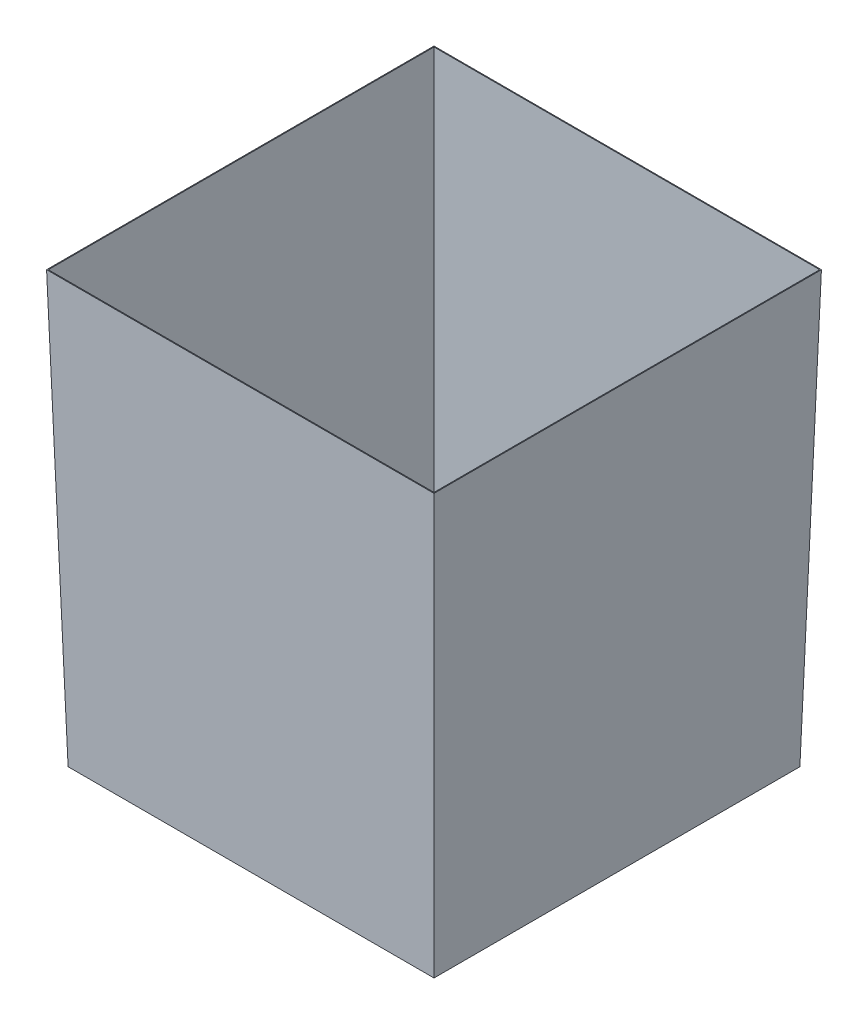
ISO-10303-21;
HEADER;
FILE_DESCRIPTION(('STEP AP214'),'2;1');
FILE_NAME('part.step','',(''),(''),'','','');
FILE_SCHEMA(('AUTOMOTIVE_DESIGN { 1 0 10303 214 1 1 1 1 }'));
ENDSEC;
DATA;
#1=APPLICATION_CONTEXT('core data for automotive mechanical design processes');
#2=APPLICATION_PROTOCOL_DEFINITION('international standard','automotive_design',2000,#1);
#3=PRODUCT_CONTEXT('',#1,'mechanical');
#4=PRODUCT('Part','Part','',(#3));
#5=PRODUCT_RELATED_PRODUCT_CATEGORY('part','',(#4));
#6=PRODUCT_DEFINITION_FORMATION('','',#4);
#7=PRODUCT_DEFINITION_CONTEXT('part definition',#1,'design');
#8=PRODUCT_DEFINITION('design','',#6,#7);
#9=PRODUCT_DEFINITION_SHAPE('','',#8);
#10=(LENGTH_UNIT() NAMED_UNIT(*) SI_UNIT(.MILLI.,.METRE.));
#11=(NAMED_UNIT(*) PLANE_ANGLE_UNIT() SI_UNIT($,.RADIAN.));
#12=(NAMED_UNIT(*) SI_UNIT($,.STERADIAN.) SOLID_ANGLE_UNIT());
#13=UNCERTAINTY_MEASURE_WITH_UNIT(LENGTH_MEASURE(1.E-05),#10,'distance_accuracy_value','');
#14=(GEOMETRIC_REPRESENTATION_CONTEXT(3) GLOBAL_UNCERTAINTY_ASSIGNED_CONTEXT((#13)) GLOBAL_UNIT_ASSIGNED_CONTEXT((#10,
#11,#12)) REPRESENTATION_CONTEXT('',''));
#15=CARTESIAN_POINT('',(0.,0.,0.));
#16=DIRECTION('',(0.,0.,1.));
#17=DIRECTION('',(1.,0.,0.));
#18=AXIS2_PLACEMENT_3D('',#15,#16,#17);
#19=CARTESIAN_POINT('',(0.,1000.,0.));
#20=DIRECTION('',(0.,-1.,0.));
#21=DIRECTION('',(0.,0.,-1.));
#22=AXIS2_PLACEMENT_3D('',#19,#20,#21);
#23=PLANE('',#22);
#24=DIRECTION('',(0.,0.,1.));
#25=VECTOR('',#24,1.);
#26=CARTESIAN_POINT('',(-450.,1000.,450.));
#27=LINE('',#26,#25);
#28=CARTESIAN_POINT('',(-450.,1000.,-450.));
#29=VERTEX_POINT('',#28);
#30=CARTESIAN_POINT('',(-450.,1000.,450.));
#31=VERTEX_POINT('',#30);
#32=EDGE_CURVE('E224',#29,#31,#27,.T.);
#33=ORIENTED_EDGE('',*,*,#32,.T.);
#34=DIRECTION('',(1.,0.,0.));
#35=VECTOR('',#34,1.);
#36=CARTESIAN_POINT('',(-450.,1000.,450.));
#37=LINE('',#36,#35);
#38=CARTESIAN_POINT('',(450.,1000.,450.));
#39=VERTEX_POINT('',#38);
#40=EDGE_CURVE('E12',#31,#39,#37,.T.);
#41=ORIENTED_EDGE('',*,*,#40,.T.);
#42=DIRECTION('',(0.,0.,-1.));
#43=VECTOR('',#42,1.);
#44=CARTESIAN_POINT('',(450.,1000.,450.));
#45=LINE('',#44,#43);
#46=CARTESIAN_POINT('',(450.,1000.,-450.));
#47=VERTEX_POINT('',#46);
#48=EDGE_CURVE('E59',#39,#47,#45,.T.);
#49=ORIENTED_EDGE('',*,*,#48,.T.);
#50=DIRECTION('',(-1.,0.,0.));
#51=VECTOR('',#50,1.);
#52=CARTESIAN_POINT('',(-450.,1000.,-450.));
#53=LINE('',#52,#51);
#54=EDGE_CURVE('E74',#47,#29,#53,.T.);
#55=ORIENTED_EDGE('',*,*,#54,.T.);
#56=EDGE_LOOP('',(#33,#41,#49,#55));
#57=FACE_BOUND('',#56,.T.);
#58=DIRECTION('',(0.,0.,1.));
#59=VECTOR('',#58,1.);
#60=CARTESIAN_POINT('',(-447.999375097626,1000.,0.));
#61=LINE('',#60,#59);
#62=CARTESIAN_POINT('',(-447.999375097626,1000.,-447.999375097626));
#63=VERTEX_POINT('',#62);
#64=CARTESIAN_POINT('',(-447.999375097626,1000.,447.999375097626));
#65=VERTEX_POINT('',#64);
#66=EDGE_CURVE('E148',#63,#65,#61,.T.);
#67=ORIENTED_EDGE('',*,*,#66,.F.);
#68=DIRECTION('',(-1.,0.,0.));
#69=VECTOR('',#68,1.);
#70=CARTESIAN_POINT('',(0.,1000.,-447.999375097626));
#71=LINE('',#70,#69);
#72=CARTESIAN_POINT('',(447.999375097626,1000.,-447.999375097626));
#73=VERTEX_POINT('',#72);
#74=EDGE_CURVE('E132',#73,#63,#71,.T.);
#75=ORIENTED_EDGE('',*,*,#74,.F.);
#76=DIRECTION('',(0.,0.,-1.));
#77=VECTOR('',#76,1.);
#78=CARTESIAN_POINT('',(447.999375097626,1000.,0.));
#79=LINE('',#78,#77);
#80=CARTESIAN_POINT('',(447.999375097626,1000.,447.999375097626));
#81=VERTEX_POINT('',#80);
#82=EDGE_CURVE('E153',#81,#73,#79,.T.);
#83=ORIENTED_EDGE('',*,*,#82,.F.);
#84=DIRECTION('',(1.,0.,0.));
#85=VECTOR('',#84,1.);
#86=CARTESIAN_POINT('',(0.,1000.,447.999375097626));
#87=LINE('',#86,#85);
#88=EDGE_CURVE('E147',#65,#81,#87,.T.);
#89=ORIENTED_EDGE('',*,*,#88,.F.);
#90=EDGE_LOOP('',(#67,#75,#83,#89));
#91=FACE_BOUND('',#90,.T.);
#92=ADVANCED_FACE('F48',(#57,#91),#23,.F.);
#93=CARTESIAN_POINT('',(0.,0.,0.));
#94=DIRECTION('',(0.,-1.,0.));
#95=DIRECTION('',(0.,0.,-1.));
#96=AXIS2_PLACEMENT_3D('',#93,#94,#95);
#97=PLANE('',#96);
#98=DIRECTION('',(0.,0.,1.));
#99=VECTOR('',#98,1.);
#100=CARTESIAN_POINT('',(-425.,0.,425.));
#101=LINE('',#100,#99);
#102=CARTESIAN_POINT('',(-425.,0.,-425.));
#103=VERTEX_POINT('',#102);
#104=CARTESIAN_POINT('',(-425.,0.,425.));
#105=VERTEX_POINT('',#104);
#106=EDGE_CURVE('E155',#103,#105,#101,.T.);
#107=ORIENTED_EDGE('',*,*,#106,.F.);
#108=DIRECTION('',(-1.,0.,0.));
#109=VECTOR('',#108,1.);
#110=CARTESIAN_POINT('',(-425.,0.,-425.));
#111=LINE('',#110,#109);
#112=CARTESIAN_POINT('',(425.,0.,-425.));
#113=VERTEX_POINT('',#112);
#114=EDGE_CURVE('E268',#113,#103,#111,.T.);
#115=ORIENTED_EDGE('',*,*,#114,.F.);
#116=DIRECTION('',(0.,0.,-1.));
#117=VECTOR('',#116,1.);
#118=CARTESIAN_POINT('',(425.,0.,425.));
#119=LINE('',#118,#117);
#120=CARTESIAN_POINT('',(425.,0.,425.));
#121=VERTEX_POINT('',#120);
#122=EDGE_CURVE('E285',#121,#113,#119,.T.);
#123=ORIENTED_EDGE('',*,*,#122,.F.);
#124=DIRECTION('',(1.,0.,0.));
#125=VECTOR('',#124,1.);
#126=CARTESIAN_POINT('',(-425.,0.,425.));
#127=LINE('',#126,#125);
#128=EDGE_CURVE('E161',#105,#121,#127,.T.);
#129=ORIENTED_EDGE('',*,*,#128,.F.);
#130=EDGE_LOOP('',(#107,#115,#123,#129));
#131=FACE_BOUND('',#130,.T.);
#132=ADVANCED_FACE('F236',(#131),#97,.T.);
#133=CARTESIAN_POINT('',(-424.73454091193,-10.6183635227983,0.));
#134=DIRECTION('',(0.999687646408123,0.0249921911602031,0.));
#135=DIRECTION('',(-0.0249921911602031,0.999687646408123,0.));
#136=AXIS2_PLACEMENT_3D('',#133,#134,#135);
#137=PLANE('',#136);
#138=DIRECTION('',(-0.0249843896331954,0.999375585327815,0.0249843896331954));
#139=VECTOR('',#138,1.);
#140=CARTESIAN_POINT('',(-425.,0.,425.));
#141=LINE('',#140,#139);
#142=EDGE_CURVE('E170',#105,#31,#141,.T.);
#143=ORIENTED_EDGE('',*,*,#142,.T.);
#144=ORIENTED_EDGE('',*,*,#32,.F.);
#145=DIRECTION('',(-0.0249843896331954,0.999375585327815,-0.0249843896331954));
#146=VECTOR('',#145,1.);
#147=CARTESIAN_POINT('',(-425.,0.,-425.));
#148=LINE('',#147,#146);
#149=EDGE_CURVE('E254',#103,#29,#148,.T.);
#150=ORIENTED_EDGE('',*,*,#149,.F.);
#151=ORIENTED_EDGE('',*,*,#106,.T.);
#152=EDGE_LOOP('',(#143,#144,#150,#151));
#153=FACE_BOUND('',#152,.T.);
#154=ADVANCED_FACE('F229',(#153),#137,.F.);
#155=CARTESIAN_POINT('',(0.,-10.6183635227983,-424.73454091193));
#156=DIRECTION('',(0.,0.0249921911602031,0.999687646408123));
#157=DIRECTION('',(0.,-0.999687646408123,0.0249921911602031));
#158=AXIS2_PLACEMENT_3D('',#155,#156,#157);
#159=PLANE('',#158);
#160=ORIENTED_EDGE('',*,*,#149,.T.);
#161=ORIENTED_EDGE('',*,*,#54,.F.);
#162=DIRECTION('',(0.0249843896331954,0.999375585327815,-0.0249843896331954));
#163=VECTOR('',#162,1.);
#164=CARTESIAN_POINT('',(425.,0.,-425.));
#165=LINE('',#164,#163);
#166=EDGE_CURVE('E271',#113,#47,#165,.T.);
#167=ORIENTED_EDGE('',*,*,#166,.F.);
#168=ORIENTED_EDGE('',*,*,#114,.T.);
#169=EDGE_LOOP('',(#160,#161,#167,#168));
#170=FACE_BOUND('',#169,.T.);
#171=ADVANCED_FACE('F178',(#170),#159,.F.);
#172=CARTESIAN_POINT('',(0.,-10.6183635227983,424.73454091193));
#173=DIRECTION('',(0.,0.0249921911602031,-0.999687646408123));
#174=DIRECTION('',(0.,0.999687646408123,0.0249921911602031));
#175=AXIS2_PLACEMENT_3D('',#172,#173,#174);
#176=PLANE('',#175);
#177=DIRECTION('',(0.0249843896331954,0.999375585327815,0.0249843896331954));
#178=VECTOR('',#177,1.);
#179=CARTESIAN_POINT('',(425.,0.,425.));
#180=LINE('',#179,#178);
#181=EDGE_CURVE('E260',#121,#39,#180,.T.);
#182=ORIENTED_EDGE('',*,*,#181,.T.);
#183=ORIENTED_EDGE('',*,*,#40,.F.);
#184=ORIENTED_EDGE('',*,*,#142,.F.);
#185=ORIENTED_EDGE('',*,*,#128,.T.);
#186=EDGE_LOOP('',(#182,#183,#184,#185));
#187=FACE_BOUND('',#186,.T.);
#188=ADVANCED_FACE('F166',(#187),#176,.F.);
#189=CARTESIAN_POINT('',(424.73454091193,-10.6183635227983,0.));
#190=DIRECTION('',(-0.999687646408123,0.0249921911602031,0.));
#191=DIRECTION('',(-0.0249921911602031,-0.999687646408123,0.));
#192=AXIS2_PLACEMENT_3D('',#189,#190,#191);
#193=PLANE('',#192);
#194=ORIENTED_EDGE('',*,*,#166,.T.);
#195=ORIENTED_EDGE('',*,*,#48,.F.);
#196=ORIENTED_EDGE('',*,*,#181,.F.);
#197=ORIENTED_EDGE('',*,*,#122,.T.);
#198=EDGE_LOOP('',(#194,#195,#196,#197));
#199=FACE_BOUND('',#198,.T.);
#200=ADVANCED_FACE('F177',(#199),#193,.F.);
#201=CARTESIAN_POINT('',(0.,2.,0.));
#202=DIRECTION('',(0.,-1.,0.));
#203=DIRECTION('',(0.,0.,-1.));
#204=AXIS2_PLACEMENT_3D('',#201,#202,#203);
#205=PLANE('',#204);
#206=DIRECTION('',(0.,0.,1.));
#207=VECTOR('',#206,1.);
#208=CARTESIAN_POINT('',(-423.049375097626,2.,0.));
#209=LINE('',#208,#207);
#210=CARTESIAN_POINT('',(-423.049375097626,2.,-423.049375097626));
#211=VERTEX_POINT('',#210);
#212=CARTESIAN_POINT('',(-423.049375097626,2.,423.049375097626));
#213=VERTEX_POINT('',#212);
#214=EDGE_CURVE('E125',#211,#213,#209,.T.);
#215=ORIENTED_EDGE('',*,*,#214,.T.);
#216=DIRECTION('',(1.,0.,0.));
#217=VECTOR('',#216,1.);
#218=CARTESIAN_POINT('',(0.,2.,423.049375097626));
#219=LINE('',#218,#217);
#220=CARTESIAN_POINT('',(423.049375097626,2.,423.049375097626));
#221=VERTEX_POINT('',#220);
#222=EDGE_CURVE('E142',#213,#221,#219,.T.);
#223=ORIENTED_EDGE('',*,*,#222,.T.);
#224=DIRECTION('',(0.,0.,-1.));
#225=VECTOR('',#224,1.);
#226=CARTESIAN_POINT('',(423.049375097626,2.,0.));
#227=LINE('',#226,#225);
#228=CARTESIAN_POINT('',(423.049375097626,2.,-423.049375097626));
#229=VERTEX_POINT('',#228);
#230=EDGE_CURVE('E124',#221,#229,#227,.T.);
#231=ORIENTED_EDGE('',*,*,#230,.T.);
#232=DIRECTION('',(-1.,0.,0.));
#233=VECTOR('',#232,1.);
#234=CARTESIAN_POINT('',(0.,2.,-423.049375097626));
#235=LINE('',#234,#233);
#236=EDGE_CURVE('E120',#229,#211,#235,.T.);
#237=ORIENTED_EDGE('',*,*,#236,.T.);
#238=EDGE_LOOP('',(#215,#223,#231,#237));
#239=FACE_BOUND('',#238,.T.);
#240=ADVANCED_FACE('F119',(#239),#205,.F.);
#241=CARTESIAN_POINT('',(-422.735165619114,-10.5683791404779,0.));
#242=DIRECTION('',(0.999687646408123,0.0249921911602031,0.));
#243=DIRECTION('',(-0.0249921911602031,0.999687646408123,0.));
#244=AXIS2_PLACEMENT_3D('',#241,#242,#243);
#245=PLANE('',#244);
#246=DIRECTION('',(-0.0249843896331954,0.999375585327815,0.0249843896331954));
#247=VECTOR('',#246,1.);
#248=CARTESIAN_POINT('',(-422.471285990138,-21.1235642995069,422.471285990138));
#249=LINE('',#248,#247);
#250=EDGE_CURVE('E136',#213,#65,#249,.T.);
#251=ORIENTED_EDGE('',*,*,#250,.F.);
#252=ORIENTED_EDGE('',*,*,#214,.F.);
#253=DIRECTION('',(-0.0249843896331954,0.999375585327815,-0.0249843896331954));
#254=VECTOR('',#253,1.);
#255=CARTESIAN_POINT('',(-422.471285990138,-21.1235642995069,-422.471285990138));
#256=LINE('',#255,#254);
#257=EDGE_CURVE('E126',#211,#63,#256,.T.);
#258=ORIENTED_EDGE('',*,*,#257,.T.);
#259=ORIENTED_EDGE('',*,*,#66,.T.);
#260=EDGE_LOOP('',(#251,#252,#258,#259));
#261=FACE_BOUND('',#260,.T.);
#262=ADVANCED_FACE('F137',(#261),#245,.T.);
#263=CARTESIAN_POINT('',(0.,-10.5683791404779,-422.735165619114));
#264=DIRECTION('',(0.,0.0249921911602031,0.999687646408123));
#265=DIRECTION('',(0.,-0.999687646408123,0.0249921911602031));
#266=AXIS2_PLACEMENT_3D('',#263,#264,#265);
#267=PLANE('',#266);
#268=ORIENTED_EDGE('',*,*,#257,.F.);
#269=ORIENTED_EDGE('',*,*,#236,.F.);
#270=DIRECTION('',(0.0249843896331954,0.999375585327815,-0.0249843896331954));
#271=VECTOR('',#270,1.);
#272=CARTESIAN_POINT('',(422.471285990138,-21.1235642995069,-422.471285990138));
#273=LINE('',#272,#271);
#274=EDGE_CURVE('E66',#229,#73,#273,.T.);
#275=ORIENTED_EDGE('',*,*,#274,.T.);
#276=ORIENTED_EDGE('',*,*,#74,.T.);
#277=EDGE_LOOP('',(#268,#269,#275,#276));
#278=FACE_BOUND('',#277,.T.);
#279=ADVANCED_FACE('F129',(#278),#267,.T.);
#280=CARTESIAN_POINT('',(0.,-10.5683791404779,422.735165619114));
#281=DIRECTION('',(0.,0.0249921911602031,-0.999687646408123));
#282=DIRECTION('',(0.,0.999687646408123,0.0249921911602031));
#283=AXIS2_PLACEMENT_3D('',#280,#281,#282);
#284=PLANE('',#283);
#285=DIRECTION('',(0.0249843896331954,0.999375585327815,0.0249843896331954));
#286=VECTOR('',#285,1.);
#287=CARTESIAN_POINT('',(422.471285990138,-21.1235642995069,422.471285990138));
#288=LINE('',#287,#286);
#289=EDGE_CURVE('E131',#221,#81,#288,.T.);
#290=ORIENTED_EDGE('',*,*,#289,.F.);
#291=ORIENTED_EDGE('',*,*,#222,.F.);
#292=ORIENTED_EDGE('',*,*,#250,.T.);
#293=ORIENTED_EDGE('',*,*,#88,.T.);
#294=EDGE_LOOP('',(#290,#291,#292,#293));
#295=FACE_BOUND('',#294,.T.);
#296=ADVANCED_FACE('F296',(#295),#284,.T.);
#297=CARTESIAN_POINT('',(422.735165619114,-10.5683791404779,0.));
#298=DIRECTION('',(-0.999687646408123,0.0249921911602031,0.));
#299=DIRECTION('',(-0.0249921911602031,-0.999687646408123,0.));
#300=AXIS2_PLACEMENT_3D('',#297,#298,#299);
#301=PLANE('',#300);
#302=ORIENTED_EDGE('',*,*,#274,.F.);
#303=ORIENTED_EDGE('',*,*,#230,.F.);
#304=ORIENTED_EDGE('',*,*,#289,.T.);
#305=ORIENTED_EDGE('',*,*,#82,.T.);
#306=EDGE_LOOP('',(#302,#303,#304,#305));
#307=FACE_BOUND('',#306,.T.);
#308=ADVANCED_FACE('F305',(#307),#301,.T.);
#309=CLOSED_SHELL('',(#92,#132,#154,#171,#188,#200,#240,#262,#279,#296,#308));
#310=MANIFOLD_SOLID_BREP('B2',#309);
#311=ADVANCED_BREP_SHAPE_REPRESENTATION('',(#18,#310),#14);
#312=SHAPE_DEFINITION_REPRESENTATION(#9,#311);
ENDSEC;
END-ISO-10303-21;
